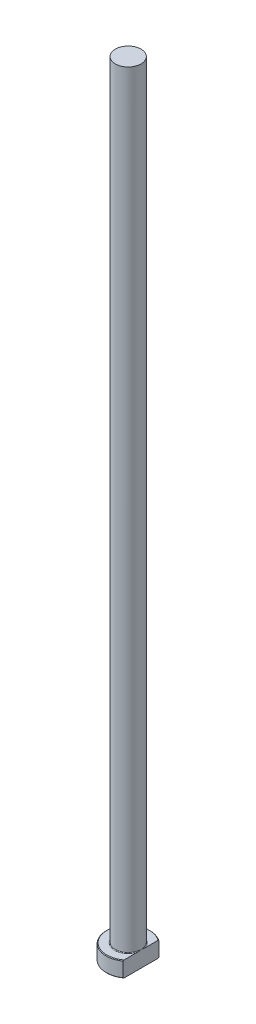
ISO-10303-21;
HEADER;
FILE_DESCRIPTION(('STEP AP214'),'2;1');
FILE_NAME('part.step','',(''),(''),'','','');
FILE_SCHEMA(('AUTOMOTIVE_DESIGN { 1 0 10303 214 1 1 1 1 }'));
ENDSEC;
DATA;
#1=APPLICATION_CONTEXT('core data for automotive mechanical design processes');
#2=APPLICATION_PROTOCOL_DEFINITION('international standard','automotive_design',2000,#1);
#3=PRODUCT_CONTEXT('',#1,'mechanical');
#4=PRODUCT('Part','Part','',(#3));
#5=PRODUCT_RELATED_PRODUCT_CATEGORY('part','',(#4));
#6=PRODUCT_DEFINITION_FORMATION('','',#4);
#7=PRODUCT_DEFINITION_CONTEXT('part definition',#1,'design');
#8=PRODUCT_DEFINITION('design','',#6,#7);
#9=PRODUCT_DEFINITION_SHAPE('','',#8);
#10=(LENGTH_UNIT() NAMED_UNIT(*) SI_UNIT(.MILLI.,.METRE.));
#11=(NAMED_UNIT(*) PLANE_ANGLE_UNIT() SI_UNIT($,.RADIAN.));
#12=(NAMED_UNIT(*) SI_UNIT($,.STERADIAN.) SOLID_ANGLE_UNIT());
#13=UNCERTAINTY_MEASURE_WITH_UNIT(LENGTH_MEASURE(1.E-05),#10,'distance_accuracy_value','');
#14=(GEOMETRIC_REPRESENTATION_CONTEXT(3) GLOBAL_UNCERTAINTY_ASSIGNED_CONTEXT((#13)) GLOBAL_UNIT_ASSIGNED_CONTEXT((#10,
#11,#12)) REPRESENTATION_CONTEXT('',''));
#15=CARTESIAN_POINT('',(0.,0.,0.));
#16=DIRECTION('',(0.,0.,1.));
#17=DIRECTION('',(1.,0.,0.));
#18=AXIS2_PLACEMENT_3D('',#15,#16,#17);
#19=CARTESIAN_POINT('',(0.,0.,0.));
#20=DIRECTION('',(0.,-1.,0.));
#21=DIRECTION('',(0.,0.,-1.));
#22=AXIS2_PLACEMENT_3D('',#19,#20,#21);
#23=PLANE('',#22);
#24=CARTESIAN_POINT('',(0.,0.,0.));
#25=DIRECTION('',(0.,-1.,0.));
#26=DIRECTION('',(0.,0.,-1.));
#27=AXIS2_PLACEMENT_3D('',#24,#25,#26);
#28=CIRCLE('',#27,6.79999999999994);
#29=CARTESIAN_POINT('',(4.09999999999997,0.,5.42494239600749));
#30=VERTEX_POINT('',#29);
#31=CARTESIAN_POINT('',(4.09999999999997,0.,-5.42494239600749));
#32=VERTEX_POINT('',#31);
#33=EDGE_CURVE('E98',#30,#32,#28,.T.);
#34=ORIENTED_EDGE('',*,*,#33,.T.);
#35=DIRECTION('',(0.,0.,1.));
#36=VECTOR('',#35,1.);
#37=CARTESIAN_POINT('',(4.09999999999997,0.,-5.6736231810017));
#38=LINE('',#37,#36);
#39=EDGE_CURVE('E83',#32,#30,#38,.T.);
#40=ORIENTED_EDGE('',*,*,#39,.T.);
#41=EDGE_LOOP('',(#34,#40));
#42=FACE_BOUND('',#41,.T.);
#43=ADVANCED_FACE('F32',(#42),#23,.T.);
#44=CARTESIAN_POINT('',(0.,259.958771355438,0.));
#45=DIRECTION('',(0.,1.,0.));
#46=DIRECTION('',(0.,0.,1.));
#47=AXIS2_PLACEMENT_3D('',#44,#45,#46);
#48=CYLINDRICAL_SURFACE('',#47,6.99999999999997);
#49=CARTESIAN_POINT('',(0.,4.80000000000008,0.));
#50=DIRECTION('',(0.,1.,0.));
#51=DIRECTION('',(0.,0.,1.));
#52=AXIS2_PLACEMENT_3D('',#49,#50,#51);
#53=CIRCLE('',#52,6.99999999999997);
#54=CARTESIAN_POINT('',(4.09999999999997,4.80000000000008,5.6736231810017));
#55=VERTEX_POINT('',#54);
#56=CARTESIAN_POINT('',(4.09999999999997,4.80000000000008,-5.6736231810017));
#57=VERTEX_POINT('',#56);
#58=EDGE_CURVE('E104',#55,#57,#53,.F.);
#59=ORIENTED_EDGE('',*,*,#58,.T.);
#60=DIRECTION('',(0.,-1.,0.));
#61=VECTOR('',#60,1.);
#62=CARTESIAN_POINT('',(4.09999999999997,250.,-5.6736231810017));
#63=LINE('',#62,#61);
#64=CARTESIAN_POINT('',(4.09999999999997,0.200000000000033,-5.6736231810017));
#65=VERTEX_POINT('',#64);
#66=EDGE_CURVE('E183',#57,#65,#63,.T.);
#67=ORIENTED_EDGE('',*,*,#66,.T.);
#68=CARTESIAN_POINT('',(0.,0.200000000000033,0.));
#69=DIRECTION('',(0.,-1.,0.));
#70=DIRECTION('',(0.,0.,-1.));
#71=AXIS2_PLACEMENT_3D('',#68,#69,#70);
#72=CIRCLE('',#71,6.99999999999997);
#73=CARTESIAN_POINT('',(4.09999999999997,0.200000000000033,5.6736231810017));
#74=VERTEX_POINT('',#73);
#75=EDGE_CURVE('E100',#65,#74,#72,.F.);
#76=ORIENTED_EDGE('',*,*,#75,.T.);
#77=DIRECTION('',(0.,-1.,0.));
#78=VECTOR('',#77,1.);
#79=CARTESIAN_POINT('',(4.09999999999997,250.,5.6736231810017));
#80=LINE('',#79,#78);
#81=EDGE_CURVE('E93',#55,#74,#80,.T.);
#82=ORIENTED_EDGE('',*,*,#81,.F.);
#83=EDGE_LOOP('',(#59,#67,#76,#82));
#84=FACE_BOUND('',#83,.T.);
#85=ADVANCED_FACE('F158',(#84),#48,.T.);
#86=CARTESIAN_POINT('',(-6.99999999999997,5.,0.));
#87=DIRECTION('',(0.,1.,0.));
#88=DIRECTION('',(0.,0.,1.));
#89=AXIS2_PLACEMENT_3D('',#86,#87,#88);
#90=PLANE('',#89);
#91=CARTESIAN_POINT('',(0.,5.,0.));
#92=DIRECTION('',(0.,1.,0.));
#93=DIRECTION('',(0.,0.,1.));
#94=AXIS2_PLACEMENT_3D('',#91,#92,#93);
#95=CIRCLE('',#94,6.80000000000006);
#96=CARTESIAN_POINT('',(4.09999999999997,5.,-5.42494239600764));
#97=VERTEX_POINT('',#96);
#98=CARTESIAN_POINT('',(4.09999999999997,5.,5.42494239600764));
#99=VERTEX_POINT('',#98);
#100=EDGE_CURVE('E178',#97,#99,#95,.T.);
#101=ORIENTED_EDGE('',*,*,#100,.T.);
#102=DIRECTION('',(0.,0.,-1.));
#103=VECTOR('',#102,1.);
#104=CARTESIAN_POINT('',(4.09999999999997,5.,0.));
#105=LINE('',#104,#103);
#106=CARTESIAN_POINT('',(4.09999999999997,4.99999999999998,1.29614813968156));
#107=VERTEX_POINT('',#106);
#108=EDGE_CURVE('E57',#99,#107,#105,.T.);
#109=ORIENTED_EDGE('',*,*,#108,.T.);
#110=CARTESIAN_POINT('',(0.,5.,0.));
#111=DIRECTION('',(0.,1.,0.));
#112=DIRECTION('',(0.,0.,1.));
#113=AXIS2_PLACEMENT_3D('',#110,#111,#112);
#114=CIRCLE('',#113,4.29999999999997);
#115=CARTESIAN_POINT('',(4.09999999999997,4.99999999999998,-1.29614813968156));
#116=VERTEX_POINT('',#115);
#117=EDGE_CURVE('E107',#107,#116,#114,.F.);
#118=ORIENTED_EDGE('',*,*,#117,.T.);
#119=EDGE_CURVE('E136',#116,#97,#105,.T.);
#120=ORIENTED_EDGE('',*,*,#119,.T.);
#121=EDGE_LOOP('',(#101,#109,#118,#120));
#122=FACE_BOUND('',#121,.T.);
#123=ADVANCED_FACE('F147',(#122),#90,.T.);
#124=CARTESIAN_POINT('',(0.,5.,0.));
#125=DIRECTION('',(0.,-1.,0.));
#126=DIRECTION('',(0.,0.,-1.));
#127=AXIS2_PLACEMENT_3D('',#124,#125,#126);
#128=CONICAL_SURFACE('',#127,6.80000000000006,0.785398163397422);
#129=ORIENTED_EDGE('',*,*,#58,.F.);
#130=CARTESIAN_POINT('',(4.09999999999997,-1.33929192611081,12.483228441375));
#131=CARTESIAN_POINT('',(4.09999999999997,-1.13691180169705,12.2702073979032));
#132=CARTESIAN_POINT('',(4.09999999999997,-0.934791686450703,12.0569390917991));
#133=CARTESIAN_POINT('',(4.09999999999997,-0.531169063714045,11.6298164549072));
#134=CARTESIAN_POINT('',(4.09999999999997,-0.329666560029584,11.4159621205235));
#135=CARTESIAN_POINT('',(4.09999999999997,0.273965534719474,10.7731725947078));
#136=CARTESIAN_POINT('',(4.09999999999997,0.675017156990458,10.3432236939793));
#137=CARTESIAN_POINT('',(4.09999999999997,1.47875431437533,9.47345436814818));
#138=CARTESIAN_POINT('',(4.09999999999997,1.88138218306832,9.03358046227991));
#139=CARTESIAN_POINT('',(4.09999999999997,2.48056970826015,8.36963259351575));
#140=CARTESIAN_POINT('',(4.09999999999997,2.67946853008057,8.14767042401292));
#141=CARTESIAN_POINT('',(4.09999999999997,3.07530374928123,7.70200314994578));
#142=CARTESIAN_POINT('',(4.09999999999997,3.2722401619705,7.47829805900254));
#143=CARTESIAN_POINT('',(4.09999999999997,3.62803580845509,7.06959504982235));
#144=CARTESIAN_POINT('',(4.09999999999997,3.78730687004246,6.88495594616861));
#145=CARTESIAN_POINT('',(4.09999999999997,4.10378434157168,6.51391771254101));
#146=CARTESIAN_POINT('',(4.09999999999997,4.26099077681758,6.32751860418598));
#147=CARTESIAN_POINT('',(4.09999999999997,4.57299335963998,5.95235210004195));
#148=CARTESIAN_POINT('',(4.09999999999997,4.72778657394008,5.76358225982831));
#149=CARTESIAN_POINT('',(4.09999999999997,5.03405385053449,5.38337519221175));
#150=CARTESIAN_POINT('',(4.09999999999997,5.18552806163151,5.19193808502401));
#151=CARTESIAN_POINT('',(4.09999999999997,5.48381165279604,4.80616050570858));
#152=CARTESIAN_POINT('',(4.09999999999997,5.63063104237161,4.61182780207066));
#153=CARTESIAN_POINT('',(4.09999999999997,5.91857329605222,4.21889561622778));
#154=CARTESIAN_POINT('',(4.09999999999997,6.05969490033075,4.02029520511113));
#155=CARTESIAN_POINT('',(4.09999999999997,6.33384612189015,3.61807653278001));
#156=CARTESIAN_POINT('',(4.09999999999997,6.46688994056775,3.41446801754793));
#157=CARTESIAN_POINT('',(4.09999999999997,6.721962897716,3.00051329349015));
#158=CARTESIAN_POINT('',(4.09999999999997,6.84399822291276,2.790170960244));
#159=CARTESIAN_POINT('',(4.09999999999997,7.04294800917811,2.41613627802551));
#160=CARTESIAN_POINT('',(4.09999999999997,7.12340018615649,2.25434092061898));
#161=CARTESIAN_POINT('',(4.09999999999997,7.27278814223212,1.92538984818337));
#162=CARTESIAN_POINT('',(4.09999999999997,7.34172134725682,1.75823294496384));
#163=CARTESIAN_POINT('',(4.09999999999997,7.4639506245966,1.41984946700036));
#164=CARTESIAN_POINT('',(4.09999999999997,7.51737823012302,1.24867129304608));
#165=CARTESIAN_POINT('',(4.09999999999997,7.60539482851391,0.901532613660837));
#166=CARTESIAN_POINT('',(4.09999999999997,7.63999996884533,0.725576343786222));
#167=CARTESIAN_POINT('',(4.09999999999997,7.68036353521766,0.421086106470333));
#168=CARTESIAN_POINT('',(4.09999999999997,7.69152054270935,0.293260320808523));
#169=CARTESIAN_POINT('',(4.09999999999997,7.70182627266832,0.0371280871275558));
#170=CARTESIAN_POINT('',(4.09999999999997,7.70097696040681,-0.0911782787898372));
#171=CARTESIAN_POINT('',(4.09999999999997,7.68730446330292,-0.347367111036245));
#172=CARTESIAN_POINT('',(4.09999999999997,7.67446010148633,-0.475248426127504));
#173=CARTESIAN_POINT('',(4.09999999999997,7.63752967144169,-0.72937331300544));
#174=CARTESIAN_POINT('',(4.09999999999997,7.61344101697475,-0.855616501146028));
#175=CARTESIAN_POINT('',(4.09999999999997,7.54404317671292,-1.15392625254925));
#176=CARTESIAN_POINT('',(4.09999999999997,7.49413451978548,-1.3249203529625));
#177=CARTESIAN_POINT('',(4.09999999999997,7.37892989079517,-1.6616169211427));
#178=CARTESIAN_POINT('',(4.09999999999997,7.31362410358,-1.82731593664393));
#179=CARTESIAN_POINT('',(4.09999999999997,7.17079959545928,-2.15435858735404));
#180=CARTESIAN_POINT('',(4.09999999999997,7.09321727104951,-2.31567410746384));
#181=CARTESIAN_POINT('',(4.09999999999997,6.97004119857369,-2.55403843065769));
#182=CARTESIAN_POINT('',(4.09999999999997,6.92785402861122,-2.63288278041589));
#183=CARTESIAN_POINT('',(4.09999999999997,6.84148468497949,-2.78946923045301));
#184=CARTESIAN_POINT('',(4.09999999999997,6.79730258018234,-2.86721136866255));
#185=CARTESIAN_POINT('',(4.09999999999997,6.65934609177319,-3.10372248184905));
#186=CARTESIAN_POINT('',(4.09999999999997,6.56274427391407,-3.26084376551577));
#187=CARTESIAN_POINT('',(4.09999999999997,6.36389133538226,-3.57148434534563));
#188=CARTESIAN_POINT('',(4.09999999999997,6.26163896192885,-3.72500283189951));
#189=CARTESIAN_POINT('',(4.09999999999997,6.05267831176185,-4.02913378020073));
#190=CARTESIAN_POINT('',(4.09999999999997,5.94596678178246,-4.17974399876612));
#191=CARTESIAN_POINT('',(4.09999999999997,5.72908222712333,-4.47845767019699));
#192=CARTESIAN_POINT('',(4.09999999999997,5.61890895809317,-4.62656094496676));
#193=CARTESIAN_POINT('',(4.09999999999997,5.39553225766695,-4.92101937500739));
#194=CARTESIAN_POINT('',(4.09999999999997,5.28232219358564,-5.06736948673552));
#195=CARTESIAN_POINT('',(4.09999999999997,5.05364560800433,-5.35829836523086));
#196=CARTESIAN_POINT('',(4.09999999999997,4.9381790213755,-5.50287708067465));
#197=CARTESIAN_POINT('',(4.09999999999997,4.58900487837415,-5.93440610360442));
#198=CARTESIAN_POINT('',(4.09999999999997,4.35254037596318,-6.21912657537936));
#199=CARTESIAN_POINT('',(4.09999999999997,3.99368021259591,-6.6433615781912));
#200=CARTESIAN_POINT('',(4.09999999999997,3.87318866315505,-6.78450136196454));
#201=CARTESIAN_POINT('',(4.09999999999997,3.63111125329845,-7.06582575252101));
#202=CARTESIAN_POINT('',(4.09999999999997,3.50952545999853,-7.20601041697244));
#203=CARTESIAN_POINT('',(4.09999999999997,3.14334067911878,-7.6253764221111));
#204=CARTESIAN_POINT('',(4.09999999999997,2.89734299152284,-7.90333600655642));
#205=CARTESIAN_POINT('',(4.09999999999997,2.4029383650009,-8.45636150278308));
#206=CARTESIAN_POINT('',(4.09999999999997,2.15453550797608,-8.73143107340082));
#207=CARTESIAN_POINT('',(4.09999999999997,1.65560568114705,-9.27963529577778));
#208=CARTESIAN_POINT('',(4.09999999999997,1.40507871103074,-9.5527699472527));
#209=CARTESIAN_POINT('',(4.09999999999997,0.947239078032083,-10.0488717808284));
#210=CARTESIAN_POINT('',(4.09999999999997,0.740197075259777,-10.2720890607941));
#211=CARTESIAN_POINT('',(4.09999999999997,0.325116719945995,-10.7177199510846));
#212=CARTESIAN_POINT('',(4.09999999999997,0.117078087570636,-10.9401333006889));
#213=CARTESIAN_POINT('',(4.09999999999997,-0.298674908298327,-11.3830462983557));
#214=CARTESIAN_POINT('',(4.09999999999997,-0.506385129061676,-11.6035498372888));
#215=CARTESIAN_POINT('',(4.09999999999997,-0.922403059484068,-12.0438652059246));
#216=CARTESIAN_POINT('',(4.09999999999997,-1.13071056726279,-12.2636772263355));
#217=CARTESIAN_POINT('',(4.09999999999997,-1.33929192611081,-12.483228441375));
#218=B_SPLINE_CURVE_WITH_KNOTS('',3,(#130,#131,#132,#133,#134,#135,#136,#137,#138,#139,#140,
#141,#142,#143,#144,#145,#146,#147,#148,#149,#150,#151,#152,#153,#154,#155,#156,#157,#158,#159,
#160,#161,#162,#163,#164,#165,#166,#167,#168,#169,#170,#171,#172,#173,#174,#175,#176,#177,#178,
#179,#180,#181,#182,#183,#184,#185,#186,#187,#188,#189,#190,#191,#192,#193,#194,#195,#196,#197,
#198,#199,#200,#201,#202,#203,#204,#205,#206,#207,#208,#209,#210,#211,#212,#213,#214,#215,#216,
#217),.UNSPECIFIED.,.F.,.F.,(4,2,2,2,2,2,2,2,2,2,2,2,2,2,2,2,2,2,2,2,2,2,2,2,2,2,2,2,2,2,2,2,2,
2,2,2,2,2,2,2,2,2,2,4),(0.,0.881487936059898,1.76298129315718,3.52684938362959,5.31576438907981,
6.20987642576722,7.10398148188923,7.83549529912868,8.5670001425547,9.29933394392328,
10.0316348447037,10.7622363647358,11.4929985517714,12.2224363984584,12.9514617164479,
13.4932089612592,14.0350771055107,14.5722044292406,15.1088702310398,15.4932846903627,
15.8776362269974,16.2626676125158,16.6477876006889,17.1811942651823,17.7149418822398,
18.2515512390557,18.5197937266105,18.78802696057,19.3411787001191,19.8944535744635,
20.4481394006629,21.0018643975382,21.5569172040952,22.1119860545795,23.2222096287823,
23.778936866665,24.3356301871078,25.4491497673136,26.5610293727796,27.6729091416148,
28.5862688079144,29.4999020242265,30.4086844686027,31.3171893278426),.UNSPECIFIED.);
#219=EDGE_CURVE('E135',#55,#99,#218,.T.);
#220=ORIENTED_EDGE('',*,*,#219,.T.);
#221=ORIENTED_EDGE('',*,*,#100,.F.);
#222=EDGE_CURVE('E127',#97,#57,#218,.T.);
#223=ORIENTED_EDGE('',*,*,#222,.T.);
#224=EDGE_LOOP('',(#129,#220,#221,#223));
#225=FACE_BOUND('',#224,.T.);
#226=ADVANCED_FACE('F143',(#225),#128,.T.);
#227=CARTESIAN_POINT('',(0.,0.200000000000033,0.));
#228=DIRECTION('',(0.,1.,0.));
#229=DIRECTION('',(0.,0.,1.));
#230=AXIS2_PLACEMENT_3D('',#227,#228,#229);
#231=CONICAL_SURFACE('',#230,6.99999999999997,0.785398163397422);
#232=ORIENTED_EDGE('',*,*,#75,.F.);
#233=CARTESIAN_POINT('',(4.09999999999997,6.33929192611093,-12.483228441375));
#234=CARTESIAN_POINT('',(4.09999999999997,6.13691180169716,-12.2702073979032));
#235=CARTESIAN_POINT('',(4.09999999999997,5.93479168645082,-12.0569390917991));
#236=CARTESIAN_POINT('',(4.09999999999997,5.53116906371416,-11.6298164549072));
#237=CARTESIAN_POINT('',(4.09999999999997,5.3296665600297,-11.4159621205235));
#238=CARTESIAN_POINT('',(4.09999999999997,4.72603446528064,-10.7731725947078));
#239=CARTESIAN_POINT('',(4.09999999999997,4.32498284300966,-10.3432236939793));
#240=CARTESIAN_POINT('',(4.09999999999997,3.52124568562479,-9.47345436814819));
#241=CARTESIAN_POINT('',(4.09999999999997,3.1186178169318,-9.03358046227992));
#242=CARTESIAN_POINT('',(4.09999999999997,2.51943029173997,-8.36963259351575));
#243=CARTESIAN_POINT('',(4.09999999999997,2.32053146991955,-8.14767042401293));
#244=CARTESIAN_POINT('',(4.09999999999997,1.92469625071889,-7.70200314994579));
#245=CARTESIAN_POINT('',(4.09999999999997,1.72775983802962,-7.47829805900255));
#246=CARTESIAN_POINT('',(4.09999999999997,1.37196419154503,-7.06959504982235));
#247=CARTESIAN_POINT('',(4.09999999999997,1.21269312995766,-6.88495594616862));
#248=CARTESIAN_POINT('',(4.09999999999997,0.896215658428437,-6.51391771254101));
#249=CARTESIAN_POINT('',(4.09999999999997,0.739009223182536,-6.32751860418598));
#250=CARTESIAN_POINT('',(4.09999999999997,0.427006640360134,-5.95235210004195));
#251=CARTESIAN_POINT('',(4.09999999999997,0.27221342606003,-5.7635822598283));
#252=CARTESIAN_POINT('',(4.09999999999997,-0.0340538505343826,-5.38337519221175));
#253=CARTESIAN_POINT('',(4.09999999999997,-0.185528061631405,-5.191938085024));
#254=CARTESIAN_POINT('',(4.09999999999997,-0.48381165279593,-4.80616050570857));
#255=CARTESIAN_POINT('',(4.09999999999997,-0.630631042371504,-4.61182780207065));
#256=CARTESIAN_POINT('',(4.09999999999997,-0.918573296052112,-4.21889561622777));
#257=CARTESIAN_POINT('',(4.09999999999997,-1.05969490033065,-4.02029520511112));
#258=CARTESIAN_POINT('',(4.09999999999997,-1.33384612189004,-3.61807653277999));
#259=CARTESIAN_POINT('',(4.09999999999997,-1.46688994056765,-3.41446801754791));
#260=CARTESIAN_POINT('',(4.09999999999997,-1.7219628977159,-3.00051329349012));
#261=CARTESIAN_POINT('',(4.09999999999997,-1.84399822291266,-2.79017096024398));
#262=CARTESIAN_POINT('',(4.09999999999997,-2.042948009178,-2.41613627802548));
#263=CARTESIAN_POINT('',(4.09999999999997,-2.12340018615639,-2.25434092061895));
#264=CARTESIAN_POINT('',(4.09999999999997,-2.27278814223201,-1.92538984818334));
#265=CARTESIAN_POINT('',(4.09999999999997,-2.34172134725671,-1.75823294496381));
#266=CARTESIAN_POINT('',(4.09999999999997,-2.4639506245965,-1.41984946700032));
#267=CARTESIAN_POINT('',(4.09999999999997,-2.51737823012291,-1.24867129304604));
#268=CARTESIAN_POINT('',(4.09999999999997,-2.6053948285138,-0.901532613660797));
#269=CARTESIAN_POINT('',(4.09999999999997,-2.63999996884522,-0.725576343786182));
#270=CARTESIAN_POINT('',(4.09999999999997,-2.68036353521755,-0.421086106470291));
#271=CARTESIAN_POINT('',(4.09999999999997,-2.69152054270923,-0.29326032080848));
#272=CARTESIAN_POINT('',(4.09999999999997,-2.70182627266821,-0.0371280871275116));
#273=CARTESIAN_POINT('',(4.09999999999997,-2.70097696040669,0.0911782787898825));
#274=CARTESIAN_POINT('',(4.09999999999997,-2.6873044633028,0.347367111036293));
#275=CARTESIAN_POINT('',(4.09999999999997,-2.67446010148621,0.475248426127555));
#276=CARTESIAN_POINT('',(4.09999999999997,-2.63752967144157,0.729373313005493));
#277=CARTESIAN_POINT('',(4.09999999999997,-2.61344101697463,0.85561650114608));
#278=CARTESIAN_POINT('',(4.09999999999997,-2.54404317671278,1.15392625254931));
#279=CARTESIAN_POINT('',(4.09999999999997,-2.49413451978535,1.32492035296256));
#280=CARTESIAN_POINT('',(4.09999999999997,-2.37892989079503,1.66161692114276));
#281=CARTESIAN_POINT('',(4.09999999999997,-2.31362410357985,1.827315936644));
#282=CARTESIAN_POINT('',(4.09999999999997,-2.17079959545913,2.15435858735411));
#283=CARTESIAN_POINT('',(4.09999999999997,-2.09321727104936,2.31567410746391));
#284=CARTESIAN_POINT('',(4.09999999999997,-1.97004119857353,2.55403843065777));
#285=CARTESIAN_POINT('',(4.09999999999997,-1.92785402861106,2.63288278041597));
#286=CARTESIAN_POINT('',(4.09999999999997,-1.84148468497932,2.7894692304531));
#287=CARTESIAN_POINT('',(4.09999999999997,-1.79730258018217,2.86721136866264));
#288=CARTESIAN_POINT('',(4.09999999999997,-1.65934609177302,3.10372248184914));
#289=CARTESIAN_POINT('',(4.09999999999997,-1.56274427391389,3.26084376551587));
#290=CARTESIAN_POINT('',(4.09999999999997,-1.36389133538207,3.57148434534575));
#291=CARTESIAN_POINT('',(4.09999999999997,-1.26163896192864,3.72500283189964));
#292=CARTESIAN_POINT('',(4.09999999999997,-1.05267831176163,4.02913378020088));
#293=CARTESIAN_POINT('',(4.09999999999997,-0.945966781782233,4.17974399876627));
#294=CARTESIAN_POINT('',(4.09999999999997,-0.729082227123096,4.47845767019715));
#295=CARTESIAN_POINT('',(4.09999999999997,-0.618908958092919,4.62656094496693));
#296=CARTESIAN_POINT('',(4.09999999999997,-0.395532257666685,4.92101937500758));
#297=CARTESIAN_POINT('',(4.09999999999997,-0.282322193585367,5.06736948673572));
#298=CARTESIAN_POINT('',(4.09999999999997,-0.0536456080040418,5.35829836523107));
#299=CARTESIAN_POINT('',(4.09999999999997,0.0618209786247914,5.50287708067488));
#300=CARTESIAN_POINT('',(4.09999999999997,0.41099512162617,5.93440610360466));
#301=CARTESIAN_POINT('',(4.09999999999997,0.647459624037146,6.21912657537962));
#302=CARTESIAN_POINT('',(4.09999999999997,1.00631978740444,6.64336157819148));
#303=CARTESIAN_POINT('',(4.09999999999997,1.12681133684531,6.78450136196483));
#304=CARTESIAN_POINT('',(4.09999999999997,1.36888874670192,7.06582575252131));
#305=CARTESIAN_POINT('',(4.09999999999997,1.49047454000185,7.20601041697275));
#306=CARTESIAN_POINT('',(4.09999999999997,1.85665932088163,7.62537642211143));
#307=CARTESIAN_POINT('',(4.09999999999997,2.10265700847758,7.90333600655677));
#308=CARTESIAN_POINT('',(4.09999999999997,2.59706163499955,8.45636150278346));
#309=CARTESIAN_POINT('',(4.09999999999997,2.84546449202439,8.73143107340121));
#310=CARTESIAN_POINT('',(4.09999999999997,3.34439431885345,9.2796352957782));
#311=CARTESIAN_POINT('',(4.09999999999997,3.59492128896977,9.55276994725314));
#312=CARTESIAN_POINT('',(4.09999999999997,4.05276092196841,10.0488717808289));
#313=CARTESIAN_POINT('',(4.09999999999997,4.25980292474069,10.2720890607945));
#314=CARTESIAN_POINT('',(4.09999999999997,4.6748832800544,10.7177199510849));
#315=CARTESIAN_POINT('',(4.09999999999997,4.88292191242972,10.9401333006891));
#316=CARTESIAN_POINT('',(4.09999999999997,5.29867490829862,11.3830462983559));
#317=CARTESIAN_POINT('',(4.09999999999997,5.50638512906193,11.6035498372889));
#318=CARTESIAN_POINT('',(4.09999999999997,5.92240305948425,12.0438652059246));
#319=CARTESIAN_POINT('',(4.09999999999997,6.13071056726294,12.2636772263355));
#320=CARTESIAN_POINT('',(4.09999999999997,6.33929192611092,12.483228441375));
#321=B_SPLINE_CURVE_WITH_KNOTS('',3,(#233,#234,#235,#236,#237,#238,#239,#240,#241,#242,#243,
#244,#245,#246,#247,#248,#249,#250,#251,#252,#253,#254,#255,#256,#257,#258,#259,#260,#261,#262,
#263,#264,#265,#266,#267,#268,#269,#270,#271,#272,#273,#274,#275,#276,#277,#278,#279,#280,#281,
#282,#283,#284,#285,#286,#287,#288,#289,#290,#291,#292,#293,#294,#295,#296,#297,#298,#299,#300,
#301,#302,#303,#304,#305,#306,#307,#308,#309,#310,#311,#312,#313,#314,#315,#316,#317,#318,#319,
#320),.UNSPECIFIED.,.F.,.F.,(4,2,2,2,2,2,2,2,2,2,2,2,2,2,2,2,2,2,2,2,2,2,2,2,2,2,2,2,2,2,2,2,2,
2,2,2,2,2,2,2,2,2,2,4),(0.,0.881487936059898,1.76298129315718,3.52684938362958,5.3157643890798,
6.20987642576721,7.10398148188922,7.83549529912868,8.5670001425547,9.29933394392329,
10.0316348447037,10.7622363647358,11.4929985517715,12.2224363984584,12.9514617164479,
13.4932089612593,14.0350771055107,14.5722044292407,15.1088702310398,15.4932846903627,
15.8776362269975,16.2626676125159,16.6477876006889,17.1811942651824,17.7149418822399,
18.2515512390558,18.5197937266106,18.7880269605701,19.3411787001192,19.8944535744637,
20.4481394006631,21.0018643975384,21.5569172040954,22.1119860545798,23.2222096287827,
23.7789368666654,24.3356301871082,25.449149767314,26.5610293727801,27.6729091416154,
28.5862688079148,29.4999020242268,30.4086844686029,31.3171893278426),.UNSPECIFIED.);
#322=EDGE_CURVE('E86',#65,#32,#321,.T.);
#323=ORIENTED_EDGE('',*,*,#322,.T.);
#324=ORIENTED_EDGE('',*,*,#33,.F.);
#325=EDGE_CURVE('E89',#30,#74,#321,.T.);
#326=ORIENTED_EDGE('',*,*,#325,.T.);
#327=EDGE_LOOP('',(#232,#323,#324,#326));
#328=FACE_BOUND('',#327,.T.);
#329=ADVANCED_FACE('F97',(#328),#231,.T.);
#330=CARTESIAN_POINT('',(0.,5.19999999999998,0.));
#331=DIRECTION('',(0.,1.,0.));
#332=DIRECTION('',(0.,0.,1.));
#333=AXIS2_PLACEMENT_3D('',#330,#331,#332);
#334=TOROIDAL_SURFACE('',#333,4.29999999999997,0.2);
#335=CARTESIAN_POINT('',(4.09999999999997,5.19999999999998,0.));
#336=CARTESIAN_POINT('',(4.09999999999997,5.20000051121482,8.48177579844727E-11));
#337=CARTESIAN_POINT('',(4.09999999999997,5.2000010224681,-2.37341874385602E-07));
#338=CARTESIAN_POINT('',(4.09999999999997,5.20000197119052,-8.69991321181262E-07));
#339=CARTESIAN_POINT('',(4.09999999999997,5.20000238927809,-1.28223494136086E-06));
#340=CARTESIAN_POINT('',(4.09999999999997,5.20000327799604,-2.27653388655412E-06));
#341=CARTESIAN_POINT('',(4.09999999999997,5.20000373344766,-2.87471299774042E-06));
#342=CARTESIAN_POINT('',(4.09999999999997,5.20000453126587,-4.09830357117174E-06));
#343=CARTESIAN_POINT('',(4.09999999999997,5.20000487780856,-4.72126748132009E-06));
#344=CARTESIAN_POINT('',(4.09999999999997,5.20000620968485,-7.19543436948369E-06));
#345=CARTESIAN_POINT('',(4.09999999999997,5.20000713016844,-9.08507628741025E-06));
#346=CARTESIAN_POINT('',(4.09999999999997,5.20000860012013,-1.27786167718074E-05));
#347=CARTESIAN_POINT('',(4.09999999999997,5.2000091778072,-1.45716794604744E-05));
#348=CARTESIAN_POINT('',(4.09999999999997,5.20001167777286,-2.23278313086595E-05));
#349=CARTESIAN_POINT('',(4.09999999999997,5.20001360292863,-2.82919348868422E-05));
#350=CARTESIAN_POINT('',(4.09999999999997,5.20001636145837,-3.94393207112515E-05));
#351=CARTESIAN_POINT('',(4.09999999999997,5.20001732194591,-4.459065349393E-05));
#352=CARTESIAN_POINT('',(4.09999999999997,5.20002443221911,-8.33481274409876E-05));
#353=CARTESIAN_POINT('',(4.09999999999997,5.20002995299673,-0.000117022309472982));
#354=CARTESIAN_POINT('',(4.09999999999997,5.20005411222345,-0.000250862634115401));
#355=CARTESIAN_POINT('',(4.09999999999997,5.20007702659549,-0.000350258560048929));
#356=CARTESIAN_POINT('',(4.09999999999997,5.20016686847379,-0.000745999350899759));
#357=CARTESIAN_POINT('',(4.09999999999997,5.20023113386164,-0.00104273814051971));
#358=CARTESIAN_POINT('',(4.09999999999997,5.20048975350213,-0.00222871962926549));
#359=CARTESIAN_POINT('',(4.09999999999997,5.20068752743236,-0.00311743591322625));
#360=CARTESIAN_POINT('',(4.09999999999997,5.20151360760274,-0.00683863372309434));
#361=CARTESIAN_POINT('',(4.09999999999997,5.20213761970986,-0.00967177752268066));
#362=CARTESIAN_POINT('',(4.09999999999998,5.21060513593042,-0.0481053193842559));
#363=CARTESIAN_POINT('',(4.09999999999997,5.21847514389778,-0.0837019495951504));
#364=CARTESIAN_POINT('',(4.09999999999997,5.23497753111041,-0.15888321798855));
#365=CARTESIAN_POINT('',(4.09999999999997,5.24359721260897,-0.198470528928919));
#366=CARTESIAN_POINT('',(4.09999999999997,5.25810552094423,-0.266014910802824));
#367=CARTESIAN_POINT('',(4.09999999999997,5.26405008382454,-0.293959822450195));
#368=CARTESIAN_POINT('',(4.09999999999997,5.27562355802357,-0.34912552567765));
#369=CARTESIAN_POINT('',(4.09999999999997,5.28125665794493,-0.376345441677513));
#370=CARTESIAN_POINT('',(4.09999999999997,5.29943979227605,-0.46575599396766));
#371=CARTESIAN_POINT('',(4.09999999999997,5.31159607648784,-0.528028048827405));
#372=CARTESIAN_POINT('',(4.09999999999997,5.3345183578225,-0.653452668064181));
#373=CARTESIAN_POINT('',(4.09999999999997,5.34526982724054,-0.716607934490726));
#374=CARTESIAN_POINT('',(4.09999999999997,5.36549989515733,-0.849208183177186));
#375=CARTESIAN_POINT('',(4.09999999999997,5.37476398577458,-0.918686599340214));
#376=CARTESIAN_POINT('',(4.09999999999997,5.38955225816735,-1.05786044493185));
#377=CARTESIAN_POINT('',(4.09999999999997,5.39508786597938,-1.12755454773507));
#378=CARTESIAN_POINT('',(4.09999999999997,5.3992964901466,-1.23112590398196));
#379=CARTESIAN_POINT('',(4.09999999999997,5.40003705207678,-1.26491756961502));
#380=CARTESIAN_POINT('',(4.09999999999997,5.39995996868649,-1.33249559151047));
#381=CARTESIAN_POINT('',(4.09999999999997,5.39914270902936,-1.36628194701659));
#382=CARTESIAN_POINT('',(4.09999999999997,5.39557880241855,-1.43339843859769));
#383=CARTESIAN_POINT('',(4.09999999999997,5.39285312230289,-1.46672955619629));
#384=CARTESIAN_POINT('',(4.09999999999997,5.3849220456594,-1.53304911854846));
#385=CARTESIAN_POINT('',(4.09999999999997,5.37972044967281,-1.56603800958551));
#386=CARTESIAN_POINT('',(4.09999999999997,5.36576321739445,-1.63210333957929));
#387=CARTESIAN_POINT('',(4.09999999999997,5.35693238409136,-1.66516593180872));
#388=CARTESIAN_POINT('',(4.09999999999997,5.33956496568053,-1.71313701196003));
#389=CARTESIAN_POINT('',(4.09999999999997,5.33312382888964,-1.72879572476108));
#390=CARTESIAN_POINT('',(4.09999999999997,5.31841020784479,-1.75921181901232));
#391=CARTESIAN_POINT('',(4.09999999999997,5.31014484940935,-1.77397243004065));
#392=CARTESIAN_POINT('',(4.09999999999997,5.29597609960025,-1.79459137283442));
#393=CARTESIAN_POINT('',(4.09999999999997,5.29105059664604,-1.80111732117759));
#394=CARTESIAN_POINT('',(4.09999999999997,5.28047159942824,-1.81356806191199));
#395=CARTESIAN_POINT('',(4.09999999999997,5.27481806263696,-1.81949281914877));
#396=CARTESIAN_POINT('',(4.09999999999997,5.26378662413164,-1.82942177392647));
#397=CARTESIAN_POINT('',(4.09999999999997,5.25854825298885,-1.83357893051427));
#398=CARTESIAN_POINT('',(4.09999999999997,5.24747881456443,-1.8410175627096));
#399=CARTESIAN_POINT('',(4.09999999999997,5.24164898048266,-1.84430081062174));
#400=CARTESIAN_POINT('',(4.09999999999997,5.23103019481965,-1.84897077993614));
#401=CARTESIAN_POINT('',(4.09999999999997,5.22636142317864,-1.85062832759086));
#402=CARTESIAN_POINT('',(4.09999999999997,5.21681344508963,-1.85314556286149));
#403=CARTESIAN_POINT('',(4.09999999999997,5.21193447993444,-1.85400614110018));
#404=CARTESIAN_POINT('',(4.09999999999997,5.2020790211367,-1.8548454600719));
#405=CARTESIAN_POINT('',(4.09999999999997,5.19710220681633,-1.85482052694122));
#406=CARTESIAN_POINT('',(4.09999999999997,5.18723254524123,-1.85388227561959));
#407=CARTESIAN_POINT('',(4.09999999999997,5.18233974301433,-1.8529684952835));
#408=CARTESIAN_POINT('',(4.09999999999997,5.17301169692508,-1.85041011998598));
#409=CARTESIAN_POINT('',(4.09999999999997,5.16856577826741,-1.84880345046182));
#410=CARTESIAN_POINT('',(4.09999999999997,5.15994310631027,-1.84499014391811));
#411=CARTESIAN_POINT('',(4.09999999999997,5.15576643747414,-1.84278331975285));
#412=CARTESIAN_POINT('',(4.09999999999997,5.1448604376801,-1.83616140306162));
#413=CARTESIAN_POINT('',(4.09999999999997,5.13841060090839,-1.8312871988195));
#414=CARTESIAN_POINT('',(4.09999999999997,5.12632402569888,-1.82061430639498));
#415=CARTESIAN_POINT('',(4.09999999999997,5.12069027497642,-1.81481237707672));
#416=CARTESIAN_POINT('',(4.09999999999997,5.10569835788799,-1.79748307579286));
#417=CARTESIAN_POINT('',(4.09999999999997,5.0971810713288,-1.78523612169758));
#418=CARTESIAN_POINT('',(4.09999999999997,5.08190874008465,-1.759730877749));
#419=CARTESIAN_POINT('',(4.09999999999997,5.07515617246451,-1.74647119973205));
#420=CARTESIAN_POINT('',(4.09999999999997,5.06057670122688,-1.71404296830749));
#421=CARTESIAN_POINT('',(4.09999999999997,5.05336936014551,-1.69459894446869));
#422=CARTESIAN_POINT('',(4.09999999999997,5.04078670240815,-1.65511361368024));
#423=CARTESIAN_POINT('',(4.09999999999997,5.03541518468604,-1.63507116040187));
#424=CARTESIAN_POINT('',(4.09999999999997,5.02602669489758,-1.59438056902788));
#425=CARTESIAN_POINT('',(4.09999999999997,5.02202979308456,-1.57372787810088));
#426=CARTESIAN_POINT('',(4.09999999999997,5.01520764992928,-1.53226128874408));
#427=CARTESIAN_POINT('',(4.09999999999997,5.01238102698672,-1.51144761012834));
#428=CARTESIAN_POINT('',(4.09999999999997,5.00618826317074,-1.45642510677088));
#429=CARTESIAN_POINT('',(4.09999999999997,5.00362476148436,-1.42212636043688));
#430=CARTESIAN_POINT('',(4.09999999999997,5.00045800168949,-1.35343324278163));
#431=CARTESIAN_POINT('',(4.09999999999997,4.99985588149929,-1.31903882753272));
#432=CARTESIAN_POINT('',(4.09999999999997,5.00037893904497,-1.21560964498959));
#433=CARTESIAN_POINT('',(4.09999999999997,5.00385566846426,-1.14658832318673));
#434=CARTESIAN_POINT('',(4.09999999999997,5.01464295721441,-1.01357004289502));
#435=CARTESIAN_POINT('',(4.09999999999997,5.02167983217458,-0.949547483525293));
#436=CARTESIAN_POINT('',(4.09999999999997,5.03833051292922,-0.822416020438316));
#437=CARTESIAN_POINT('',(4.09999999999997,5.04792112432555,-0.759304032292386));
#438=CARTESIAN_POINT('',(4.09999999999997,5.06649836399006,-0.648156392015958));
#439=CARTESIAN_POINT('',(4.09999999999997,5.07509963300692,-0.60005440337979));
#440=CARTESIAN_POINT('',(4.09999999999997,5.09336865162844,-0.5027171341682));
#441=CARTESIAN_POINT('',(4.09999999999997,5.10305882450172,-0.45348607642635));
#442=CARTESIAN_POINT('',(4.09999999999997,5.12010265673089,-0.369650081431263));
#443=CARTESIAN_POINT('',(4.09999999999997,5.1273025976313,-0.335013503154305));
#444=CARTESIAN_POINT('',(4.09999999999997,5.14184386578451,-0.26617579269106));
#445=CARTESIAN_POINT('',(4.09999999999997,5.14918270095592,-0.231974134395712));
#446=CARTESIAN_POINT('',(4.09999999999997,5.16314314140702,-0.167541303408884));
#447=CARTESIAN_POINT('',(4.09999999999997,5.16974991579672,-0.137306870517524));
#448=CARTESIAN_POINT('',(4.09999999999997,5.18332308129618,-0.0755506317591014));
#449=CARTESIAN_POINT('',(4.09999999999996,5.19029270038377,-0.0440294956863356));
#450=CARTESIAN_POINT('',(4.09999999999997,5.19786353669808,-0.00966658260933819));
#451=CARTESIAN_POINT('',(4.09999999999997,5.19848867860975,-0.00682823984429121));
#452=CARTESIAN_POINT('',(4.09999999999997,5.19931502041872,-0.00310588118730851));
#453=CARTESIAN_POINT('',(4.09999999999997,5.19951189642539,-0.00222119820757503));
#454=CARTESIAN_POINT('',(4.09999999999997,5.19976942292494,-0.00104022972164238));
#455=CARTESIAN_POINT('',(4.09999999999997,5.19983347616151,-0.000744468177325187));
#456=CARTESIAN_POINT('',(4.09999999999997,5.19992306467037,-0.000349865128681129));
#457=CARTESIAN_POINT('',(4.09999999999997,5.1999459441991,-0.000250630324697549));
#458=CARTESIAN_POINT('',(4.09999999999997,5.19997007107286,-0.000116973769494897));
#459=CARTESIAN_POINT('',(4.09999999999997,5.19997558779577,-8.33211280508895E-05));
#460=CARTESIAN_POINT('',(4.09999999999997,5.19998268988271,-4.45857715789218E-05));
#461=CARTESIAN_POINT('',(4.09999999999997,5.19998364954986,-3.94355404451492E-05));
#462=CARTESIAN_POINT('',(4.09999999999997,5.19998640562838,-2.82904942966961E-05));
#463=CARTESIAN_POINT('',(4.09999999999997,5.19998832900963,-2.23275713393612E-05));
#464=CARTESIAN_POINT('',(4.09999999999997,5.19999082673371,-1.45726655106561E-05));
#465=CARTESIAN_POINT('',(4.09999999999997,5.19999140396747,-1.27796833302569E-05));
#466=CARTESIAN_POINT('',(4.09999999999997,5.19999287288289,-9.08623741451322E-06));
#467=CARTESIAN_POINT('',(4.09999999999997,5.19999379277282,-7.19659802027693E-06));
#468=CARTESIAN_POINT('',(4.09999999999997,5.19999512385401,-4.72235852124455E-06));
#469=CARTESIAN_POINT('',(4.09999999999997,5.1999954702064,-4.0993503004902E-06));
#470=CARTESIAN_POINT('',(4.09999999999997,5.19999626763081,-2.87563677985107E-06));
#471=CARTESIAN_POINT('',(4.09999999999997,5.19999672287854,-2.2773772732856E-06));
#472=CARTESIAN_POINT('',(4.09999999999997,5.19999761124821,-1.28289389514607E-06));
#473=CARTESIAN_POINT('',(4.09999999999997,5.19999802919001,-8.70554048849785E-07));
#474=CARTESIAN_POINT('',(4.09999999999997,5.19999897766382,-2.3765555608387E-07));
#475=CARTESIAN_POINT('',(4.09999999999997,5.19999948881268,-8.48131903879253E-11));
#476=CARTESIAN_POINT('',(4.09999999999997,5.19999999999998,0.));
#477=B_SPLINE_CURVE_WITH_KNOTS('',3,(#335,#336,#337,#338,#339,#340,#341,#342,#343,#344,#345,
#346,#347,#348,#349,#350,#351,#352,#353,#354,#355,#356,#357,#358,#359,#360,#361,#362,#363,#364,
#365,#366,#367,#368,#369,#370,#371,#372,#373,#374,#375,#376,#377,#378,#379,#380,#381,#382,#383,
#384,#385,#386,#387,#388,#389,#390,#391,#392,#393,#394,#395,#396,#397,#398,#399,#400,#401,#402,
#403,#404,#405,#406,#407,#408,#409,#410,#411,#412,#413,#414,#415,#416,#417,#418,#419,#420,#421,
#422,#423,#424,#425,#426,#427,#428,#429,#430,#431,#432,#433,#434,#435,#436,#437,#438,#439,#440,
#441,#442,#443,#444,#445,#446,#447,#448,#449,#450,#451,#452,#453,#454,#455,#456,#457,#458,#459,
#460,#461,#462,#463,#464,#465,#466,#467,#468,#469,#470,#471,#472,#473,#474,#475,#476),
.UNSPECIFIED.,.T.,.F.,(4,2,2,2,2,2,2,2,2,2,2,2,2,2,2,2,2,2,2,2,2,2,2,2,2,2,2,2,2,2,2,2,2,2,2,2,
2,2,2,2,2,2,2,2,2,2,2,2,2,2,2,2,2,2,2,2,2,2,2,2,2,2,2,2,2,2,2,2,2,2,4),(0.,1.56077961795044E-06,
3.3330233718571E-06,5.57220089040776E-06,7.71031786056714E-06,1.39959462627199E-05,
1.96420817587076E-05,3.84177478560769E-05,5.41207073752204E-05,0.000156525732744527,
0.000462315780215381,0.00137340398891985,0.00410448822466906,0.0128079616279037,
0.122174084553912,0.243719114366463,0.329429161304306,0.41281904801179,0.603149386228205,
0.795314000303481,1.0055338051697,1.21510641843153,1.31647802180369,1.41782453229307,
1.51807472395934,1.61817152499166,1.72045618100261,1.77118252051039,1.82171411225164,
1.84620451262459,1.87069634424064,1.89069743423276,1.91065764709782,1.92546132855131,
1.94024844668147,1.9550969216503,1.96995312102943,1.98408278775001,1.99821686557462,
2.02232905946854,2.04652741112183,2.09102796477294,2.13559065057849,2.19765435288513,
2.25984571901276,2.32290998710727,2.38589958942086,2.489000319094,2.59216085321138,
2.79925959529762,2.99242441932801,3.18389136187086,3.33047882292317,3.48099951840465,
3.58712985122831,3.69206963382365,3.78491369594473,3.88175875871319,3.89047819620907,
3.89319688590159,3.89410497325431,3.89441026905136,3.8945126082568,3.89452830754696,
3.8945470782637,3.89455272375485,3.89455900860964,3.89456114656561,3.89456338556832,
3.8945651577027,3.89456671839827),.UNSPECIFIED.);
#478=CARTESIAN_POINT('',(4.09999999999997,5.19999999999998,0.));
#479=VERTEX_POINT('',#478);
#480=EDGE_CURVE('E11',#116,#479,#477,.T.);
#481=ORIENTED_EDGE('',*,*,#480,.F.);
#482=ORIENTED_EDGE('',*,*,#117,.F.);
#483=CARTESIAN_POINT('',(4.09999999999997,5.19999999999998,0.));
#484=CARTESIAN_POINT('',(4.09999999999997,5.19999948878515,-8.48181322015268E-11));
#485=CARTESIAN_POINT('',(4.09999999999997,5.19999897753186,2.37341874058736E-07));
#486=CARTESIAN_POINT('',(4.09999999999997,5.19999802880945,8.69991321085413E-07));
#487=CARTESIAN_POINT('',(4.09999999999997,5.19999761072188,1.28223494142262E-06));
#488=CARTESIAN_POINT('',(4.09999999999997,5.19999672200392,2.27653388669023E-06));
#489=CARTESIAN_POINT('',(4.09999999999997,5.1999962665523,2.874712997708E-06));
#490=CARTESIAN_POINT('',(4.09999999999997,5.19999546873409,4.0983035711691E-06));
#491=CARTESIAN_POINT('',(4.09999999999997,5.1999951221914,4.72126748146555E-06));
#492=CARTESIAN_POINT('',(4.09999999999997,5.19999379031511,7.19543437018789E-06));
#493=CARTESIAN_POINT('',(4.09999999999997,5.19999286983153,9.0850762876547E-06));
#494=CARTESIAN_POINT('',(4.09999999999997,5.19999139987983,1.27786167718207E-05));
#495=CARTESIAN_POINT('',(4.09999999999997,5.19999082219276,1.45716794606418E-05));
#496=CARTESIAN_POINT('',(4.09999999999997,5.1999883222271,2.2327831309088E-05));
#497=CARTESIAN_POINT('',(4.09999999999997,5.19998639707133,2.82919348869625E-05));
#498=CARTESIAN_POINT('',(4.09999999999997,5.19998363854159,3.94393207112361E-05));
#499=CARTESIAN_POINT('',(4.09999999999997,5.19998267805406,4.45906534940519E-05));
#500=CARTESIAN_POINT('',(4.09999999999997,5.19997556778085,8.33481274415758E-05));
#501=CARTESIAN_POINT('',(4.09999999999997,5.19997004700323,0.000117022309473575));
#502=CARTESIAN_POINT('',(4.09999999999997,5.19994588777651,0.000250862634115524));
#503=CARTESIAN_POINT('',(4.09999999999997,5.19992297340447,0.000350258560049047));
#504=CARTESIAN_POINT('',(4.09999999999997,5.19983313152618,0.000745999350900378));
#505=CARTESIAN_POINT('',(4.09999999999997,5.19976886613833,0.00104273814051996));
#506=CARTESIAN_POINT('',(4.09999999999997,5.19951024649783,0.00222871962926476));
#507=CARTESIAN_POINT('',(4.09999999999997,5.1993124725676,0.00311743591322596));
#508=CARTESIAN_POINT('',(4.09999999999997,5.19848639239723,0.00683863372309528));
#509=CARTESIAN_POINT('',(4.09999999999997,5.19786238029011,0.0096717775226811));
#510=CARTESIAN_POINT('',(4.09999999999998,5.18939486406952,0.0481053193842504));
#511=CARTESIAN_POINT('',(4.09999999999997,5.18152485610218,0.0837019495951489));
#512=CARTESIAN_POINT('',(4.09999999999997,5.16502246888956,0.158883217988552));
#513=CARTESIAN_POINT('',(4.09999999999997,5.156402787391,0.19847052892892));
#514=CARTESIAN_POINT('',(4.09999999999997,5.14189447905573,0.266014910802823));
#515=CARTESIAN_POINT('',(4.09999999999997,5.13594991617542,0.293959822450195));
#516=CARTESIAN_POINT('',(4.09999999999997,5.12437644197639,0.34912552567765));
#517=CARTESIAN_POINT('',(4.09999999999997,5.11874334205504,0.376345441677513));
#518=CARTESIAN_POINT('',(4.09999999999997,5.10056020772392,0.46575599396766));
#519=CARTESIAN_POINT('',(4.09999999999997,5.08840392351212,0.528028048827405));
#520=CARTESIAN_POINT('',(4.09999999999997,5.06548164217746,0.65345266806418));
#521=CARTESIAN_POINT('',(4.09999999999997,5.05473017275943,0.716607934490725));
#522=CARTESIAN_POINT('',(4.09999999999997,5.03450010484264,0.849208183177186));
#523=CARTESIAN_POINT('',(4.09999999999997,5.02523601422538,0.918686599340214));
#524=CARTESIAN_POINT('',(4.09999999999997,5.01044774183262,1.05786044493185));
#525=CARTESIAN_POINT('',(4.09999999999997,5.00491213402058,1.12755454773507));
#526=CARTESIAN_POINT('',(4.09999999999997,5.00070350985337,1.23112590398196));
#527=CARTESIAN_POINT('',(4.09999999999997,4.99996294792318,1.26491756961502));
#528=CARTESIAN_POINT('',(4.09999999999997,5.00004003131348,1.33249559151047));
#529=CARTESIAN_POINT('',(4.09999999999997,5.00085729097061,1.36628194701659));
#530=CARTESIAN_POINT('',(4.09999999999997,5.00442119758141,1.43339843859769));
#531=CARTESIAN_POINT('',(4.09999999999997,5.00714687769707,1.46672955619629));
#532=CARTESIAN_POINT('',(4.09999999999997,5.01507795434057,1.53304911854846));
#533=CARTESIAN_POINT('',(4.09999999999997,5.02027955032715,1.56603800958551));
#534=CARTESIAN_POINT('',(4.09999999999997,5.03423678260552,1.63210333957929));
#535=CARTESIAN_POINT('',(4.09999999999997,5.04306761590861,1.66516593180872));
#536=CARTESIAN_POINT('',(4.09999999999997,5.06043503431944,1.71313701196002));
#537=CARTESIAN_POINT('',(4.09999999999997,5.06687617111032,1.72879572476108));
#538=CARTESIAN_POINT('',(4.09999999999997,5.08158979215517,1.75921181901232));
#539=CARTESIAN_POINT('',(4.09999999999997,5.08985515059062,1.77397243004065));
#540=CARTESIAN_POINT('',(4.09999999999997,5.10402390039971,1.79459137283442));
#541=CARTESIAN_POINT('',(4.09999999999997,5.10894940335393,1.8011173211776));
#542=CARTESIAN_POINT('',(4.09999999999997,5.11952840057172,1.81356806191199));
#543=CARTESIAN_POINT('',(4.09999999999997,5.12518193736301,1.81949281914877));
#544=CARTESIAN_POINT('',(4.09999999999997,5.13621337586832,1.82942177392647));
#545=CARTESIAN_POINT('',(4.09999999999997,5.14145174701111,1.83357893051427));
#546=CARTESIAN_POINT('',(4.09999999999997,5.15252118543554,1.8410175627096));
#547=CARTESIAN_POINT('',(4.09999999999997,5.1583510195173,1.84430081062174));
#548=CARTESIAN_POINT('',(4.09999999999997,5.16896980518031,1.84897077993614));
#549=CARTESIAN_POINT('',(4.09999999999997,5.17363857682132,1.85062832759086));
#550=CARTESIAN_POINT('',(4.09999999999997,5.18318655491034,1.85314556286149));
#551=CARTESIAN_POINT('',(4.09999999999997,5.18806552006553,1.85400614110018));
#552=CARTESIAN_POINT('',(4.09999999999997,5.19792097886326,1.8548454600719));
#553=CARTESIAN_POINT('',(4.09999999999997,5.20289779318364,1.85482052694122));
#554=CARTESIAN_POINT('',(4.09999999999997,5.21276745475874,1.85388227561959));
#555=CARTESIAN_POINT('',(4.09999999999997,5.21766025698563,1.8529684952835));
#556=CARTESIAN_POINT('',(4.09999999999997,5.22698830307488,1.85041011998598));
#557=CARTESIAN_POINT('',(4.09999999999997,5.23143422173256,1.84880345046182));
#558=CARTESIAN_POINT('',(4.09999999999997,5.2400568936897,1.84499014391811));
#559=CARTESIAN_POINT('',(4.09999999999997,5.24423356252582,1.84278331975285));
#560=CARTESIAN_POINT('',(4.09999999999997,5.25513956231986,1.83616140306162));
#561=CARTESIAN_POINT('',(4.09999999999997,5.26158939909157,1.8312871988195));
#562=CARTESIAN_POINT('',(4.09999999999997,5.27367597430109,1.82061430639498));
#563=CARTESIAN_POINT('',(4.09999999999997,5.27930972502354,1.81481237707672));
#564=CARTESIAN_POINT('',(4.09999999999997,5.29430164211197,1.79748307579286));
#565=CARTESIAN_POINT('',(4.09999999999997,5.30281892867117,1.78523612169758));
#566=CARTESIAN_POINT('',(4.09999999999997,5.31809125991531,1.759730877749));
#567=CARTESIAN_POINT('',(4.09999999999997,5.32484382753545,1.74647119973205));
#568=CARTESIAN_POINT('',(4.09999999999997,5.33942329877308,1.71404296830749));
#569=CARTESIAN_POINT('',(4.09999999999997,5.34663063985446,1.69459894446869));
#570=CARTESIAN_POINT('',(4.09999999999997,5.35921329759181,1.65511361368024));
#571=CARTESIAN_POINT('',(4.09999999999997,5.36458481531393,1.63507116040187));
#572=CARTESIAN_POINT('',(4.09999999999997,5.37397330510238,1.59438056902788));
#573=CARTESIAN_POINT('',(4.09999999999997,5.3779702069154,1.57372787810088));
#574=CARTESIAN_POINT('',(4.09999999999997,5.38479235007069,1.53226128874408));
#575=CARTESIAN_POINT('',(4.09999999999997,5.38761897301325,1.51144761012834));
#576=CARTESIAN_POINT('',(4.09999999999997,5.39381173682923,1.45642510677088));
#577=CARTESIAN_POINT('',(4.09999999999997,5.3963752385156,1.42212636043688));
#578=CARTESIAN_POINT('',(4.09999999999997,5.39954199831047,1.35343324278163));
#579=CARTESIAN_POINT('',(4.09999999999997,5.40014411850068,1.31903882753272));
#580=CARTESIAN_POINT('',(4.09999999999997,5.39962106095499,1.21560964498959));
#581=CARTESIAN_POINT('',(4.09999999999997,5.3961443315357,1.14658832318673));
#582=CARTESIAN_POINT('',(4.09999999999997,5.38535704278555,1.01357004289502));
#583=CARTESIAN_POINT('',(4.09999999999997,5.37832016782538,0.949547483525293));
#584=CARTESIAN_POINT('',(4.09999999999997,5.36166948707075,0.822416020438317));
#585=CARTESIAN_POINT('',(4.09999999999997,5.35207887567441,0.759304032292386));
#586=CARTESIAN_POINT('',(4.09999999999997,5.33350163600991,0.648156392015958));
#587=CARTESIAN_POINT('',(4.09999999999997,5.32490036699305,0.60005440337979));
#588=CARTESIAN_POINT('',(4.09999999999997,5.30663134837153,0.5027171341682));
#589=CARTESIAN_POINT('',(4.09999999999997,5.29694117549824,0.453486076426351));
#590=CARTESIAN_POINT('',(4.09999999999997,5.27989734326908,0.369650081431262));
#591=CARTESIAN_POINT('',(4.09999999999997,5.27269740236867,0.335013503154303));
#592=CARTESIAN_POINT('',(4.09999999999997,5.25815613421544,0.266175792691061));
#593=CARTESIAN_POINT('',(4.09999999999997,5.25081729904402,0.231974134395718));
#594=CARTESIAN_POINT('',(4.09999999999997,5.23685685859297,0.167541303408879));
#595=CARTESIAN_POINT('',(4.09999999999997,5.23025008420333,0.137306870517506));
#596=CARTESIAN_POINT('',(4.09999999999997,5.21667691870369,0.0755506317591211));
#597=CARTESIAN_POINT('',(4.09999999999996,5.20970729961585,0.0440294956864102));
#598=CARTESIAN_POINT('',(4.09999999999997,5.20213646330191,0.00966658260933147));
#599=CARTESIAN_POINT('',(4.09999999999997,5.20151132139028,0.00682823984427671));
#600=CARTESIAN_POINT('',(4.09999999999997,5.20068497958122,0.00310588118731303));
#601=CARTESIAN_POINT('',(4.09999999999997,5.20048810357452,0.00222119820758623));
#602=CARTESIAN_POINT('',(4.09999999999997,5.20023057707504,0.00104022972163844));
#603=CARTESIAN_POINT('',(4.09999999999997,5.2001665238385,0.000744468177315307));
#604=CARTESIAN_POINT('',(4.09999999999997,5.20007693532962,0.000349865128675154));
#605=CARTESIAN_POINT('',(4.09999999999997,5.20005405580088,0.000250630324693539));
#606=CARTESIAN_POINT('',(4.09999999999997,5.20002992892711,0.000116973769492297));
#607=CARTESIAN_POINT('',(4.09999999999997,5.20002441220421,8.33211280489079E-05));
#608=CARTESIAN_POINT('',(4.09999999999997,5.20001731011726,4.45857715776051E-05));
#609=CARTESIAN_POINT('',(4.09999999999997,5.20001635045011,3.94355404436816E-05));
#610=CARTESIAN_POINT('',(4.09999999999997,5.20001359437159,2.82904942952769E-05));
#611=CARTESIAN_POINT('',(4.09999999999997,5.20001167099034,2.23275713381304E-05));
#612=CARTESIAN_POINT('',(4.09999999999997,5.20000917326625,1.45726655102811E-05));
#613=CARTESIAN_POINT('',(4.09999999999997,5.2000085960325,1.27796833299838E-05));
#614=CARTESIAN_POINT('',(4.09999999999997,5.20000712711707,9.08623741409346E-06));
#615=CARTESIAN_POINT('',(4.09999999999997,5.20000620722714,7.19659801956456E-06));
#616=CARTESIAN_POINT('',(4.09999999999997,5.20000487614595,4.72235852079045E-06));
#617=CARTESIAN_POINT('',(4.09999999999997,5.20000452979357,4.09935030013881E-06));
#618=CARTESIAN_POINT('',(4.09999999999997,5.20000373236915,2.875636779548E-06));
#619=CARTESIAN_POINT('',(4.09999999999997,5.20000327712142,2.27737727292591E-06));
#620=CARTESIAN_POINT('',(4.09999999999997,5.20000238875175,1.28289389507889E-06));
#621=CARTESIAN_POINT('',(4.09999999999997,5.20000197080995,8.7055404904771E-07));
#622=CARTESIAN_POINT('',(4.09999999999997,5.20000102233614,2.37655556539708E-07));
#623=CARTESIAN_POINT('',(4.09999999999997,5.20000051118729,8.48135644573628E-11));
#624=CARTESIAN_POINT('',(4.09999999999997,5.19999999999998,0.));
#625=B_SPLINE_CURVE_WITH_KNOTS('',3,(#483,#484,#485,#486,#487,#488,#489,#490,#491,#492,#493,
#494,#495,#496,#497,#498,#499,#500,#501,#502,#503,#504,#505,#506,#507,#508,#509,#510,#511,#512,
#513,#514,#515,#516,#517,#518,#519,#520,#521,#522,#523,#524,#525,#526,#527,#528,#529,#530,#531,
#532,#533,#534,#535,#536,#537,#538,#539,#540,#541,#542,#543,#544,#545,#546,#547,#548,#549,#550,
#551,#552,#553,#554,#555,#556,#557,#558,#559,#560,#561,#562,#563,#564,#565,#566,#567,#568,#569,
#570,#571,#572,#573,#574,#575,#576,#577,#578,#579,#580,#581,#582,#583,#584,#585,#586,#587,#588,
#589,#590,#591,#592,#593,#594,#595,#596,#597,#598,#599,#600,#601,#602,#603,#604,#605,#606,#607,
#608,#609,#610,#611,#612,#613,#614,#615,#616,#617,#618,#619,#620,#621,#622,#623,#624),
.UNSPECIFIED.,.T.,.F.,(4,2,2,2,2,2,2,2,2,2,2,2,2,2,2,2,2,2,2,2,2,2,2,2,2,2,2,2,2,2,2,2,2,2,2,2,
2,2,2,2,2,2,2,2,2,2,2,2,2,2,2,2,2,2,2,2,2,2,2,2,2,2,2,2,2,2,2,2,2,2,4),(0.,1.56077961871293E-06,
3.33302337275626E-06,5.5722008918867E-06,7.71031786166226E-06,1.3995946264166E-05,
1.9642081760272E-05,3.84177478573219E-05,5.41207073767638E-05,0.000156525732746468,
0.00046231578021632,0.00137340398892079,0.00410448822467,0.0128079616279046,0.122174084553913,
0.243719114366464,0.329429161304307,0.412819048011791,0.603149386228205,0.795314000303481,
1.0055338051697,1.21510641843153,1.31647802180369,1.41782453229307,1.51807472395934,
1.61817152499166,1.72045618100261,1.77118252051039,1.82171411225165,1.8462045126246,
1.87069634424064,1.89069743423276,1.91065764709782,1.92546132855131,1.94024844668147,
1.9550969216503,1.96995312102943,1.98408278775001,1.99821686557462,2.02232905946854,
2.04652741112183,2.09102796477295,2.13559065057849,2.19765435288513,2.25984571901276,
2.32290998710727,2.38589958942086,2.489000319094,2.59216085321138,2.79925959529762,
2.99242441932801,3.18389136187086,3.33047882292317,3.48099951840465,3.58712985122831,
3.69206963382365,3.78491369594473,3.88175875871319,3.89047819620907,3.89319688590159,
3.89410497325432,3.89441026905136,3.8945126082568,3.89452830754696,3.8945470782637,
3.89455272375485,3.89455900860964,3.89456114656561,3.89456338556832,3.89456515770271,
3.89456671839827),.UNSPECIFIED.);
#626=EDGE_CURVE('E46',#479,#107,#625,.T.);
#627=ORIENTED_EDGE('',*,*,#626,.F.);
#628=CARTESIAN_POINT('',(0.,5.19999999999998,0.));
#629=DIRECTION('',(0.,1.,0.));
#630=DIRECTION('',(0.,0.,1.));
#631=AXIS2_PLACEMENT_3D('',#628,#629,#630);
#632=CIRCLE('',#631,4.09999999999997);
#633=EDGE_CURVE('E103',#479,#479,#632,.T.);
#634=ORIENTED_EDGE('',*,*,#633,.F.);
#635=EDGE_LOOP('',(#481,#482,#627,#634));
#636=FACE_BOUND('',#635,.T.);
#637=ADVANCED_FACE('F34',(#636),#334,.F.);
#638=CARTESIAN_POINT('',(0.,259.958771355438,0.));
#639=DIRECTION('',(0.,1.,0.));
#640=DIRECTION('',(0.,0.,1.));
#641=AXIS2_PLACEMENT_3D('',#638,#639,#640);
#642=CYLINDRICAL_SURFACE('',#641,4.09999999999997);
#643=ORIENTED_EDGE('',*,*,#633,.T.);
#644=EDGE_LOOP('',(#643));
#645=FACE_BOUND('',#644,.T.);
#646=CARTESIAN_POINT('',(0.,250.,0.));
#647=DIRECTION('',(0.,1.,0.));
#648=DIRECTION('',(0.,0.,1.));
#649=AXIS2_PLACEMENT_3D('',#646,#647,#648);
#650=CIRCLE('',#649,4.09999999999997);
#651=CARTESIAN_POINT('',(0.,250.,4.09999999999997));
#652=VERTEX_POINT('',#651);
#653=EDGE_CURVE('E101',#652,#652,#650,.T.);
#654=ORIENTED_EDGE('',*,*,#653,.F.);
#655=EDGE_LOOP('',(#654));
#656=FACE_BOUND('',#655,.T.);
#657=ADVANCED_FACE('F155',(#645,#656),#642,.T.);
#658=CARTESIAN_POINT('',(-4.09999999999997,250.,0.));
#659=DIRECTION('',(0.,1.,0.));
#660=DIRECTION('',(0.,0.,1.));
#661=AXIS2_PLACEMENT_3D('',#658,#659,#660);
#662=PLANE('',#661);
#663=ORIENTED_EDGE('',*,*,#653,.T.);
#664=EDGE_LOOP('',(#663));
#665=FACE_BOUND('',#664,.T.);
#666=ADVANCED_FACE('F121',(#665),#662,.T.);
#667=CARTESIAN_POINT('',(4.09999999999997,250.,-5.6736231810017));
#668=DIRECTION('',(1.,0.,0.));
#669=DIRECTION('',(0.,0.,-1.));
#670=AXIS2_PLACEMENT_3D('',#667,#668,#669);
#671=PLANE('',#670);
#672=ORIENTED_EDGE('',*,*,#66,.F.);
#673=ORIENTED_EDGE('',*,*,#222,.F.);
#674=ORIENTED_EDGE('',*,*,#119,.F.);
#675=ORIENTED_EDGE('',*,*,#480,.T.);
#676=ORIENTED_EDGE('',*,*,#626,.T.);
#677=ORIENTED_EDGE('',*,*,#108,.F.);
#678=ORIENTED_EDGE('',*,*,#219,.F.);
#679=ORIENTED_EDGE('',*,*,#81,.T.);
#680=ORIENTED_EDGE('',*,*,#325,.F.);
#681=ORIENTED_EDGE('',*,*,#39,.F.);
#682=ORIENTED_EDGE('',*,*,#322,.F.);
#683=EDGE_LOOP('',(#672,#673,#674,#675,#676,#677,#678,#679,#680,#681,#682));
#684=FACE_BOUND('',#683,.T.);
#685=ADVANCED_FACE('F85',(#684),#671,.T.);
#686=CLOSED_SHELL('',(#43,#85,#123,#226,#329,#637,#657,#666,#685));
#687=MANIFOLD_SOLID_BREP('B2',#686);
#688=ADVANCED_BREP_SHAPE_REPRESENTATION('',(#18,#687),#14);
#689=SHAPE_DEFINITION_REPRESENTATION(#9,#688);
ENDSEC;
END-ISO-10303-21;
